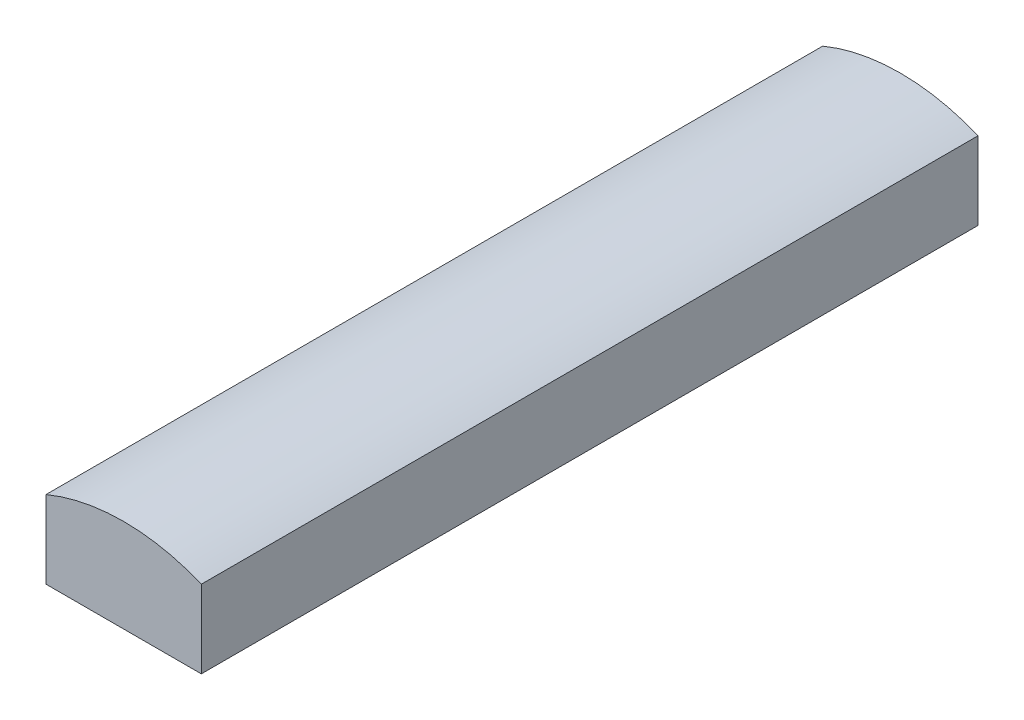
from build123d import *

# Parameters (mm, degrees)
LINEAR_AUSTRAGEN1_DEPTH         = 500.1
SKIZZE3_R                       = 0.05
LINEAR_AUSTRAGEN2_DEPTH         = 0.1
SCHNITT_LINEAR_START            = -0.1
SCHNITT_LINEAR_AUSTRAGEN1_DEPTH = 0.1


with BuildPart() as part:
    # Skizze1 → Linear austragen1 (new body)
    with BuildSketch(Plane.XY):
        with BuildLine():
            Line((50, 0), (50, 50))
            ThreePointArc((50, 50), (0, 60), (-50, 50))
            Line((-50, 50), (-50, 0))
            Line((-50, 0), (50, 0))
        make_face()
    extrude(amount=-LINEAR_AUSTRAGEN1_DEPTH)

    # Skizze3 → Linear austragen2 (add)
    with BuildSketch(Plane.XZ):
        with Locations(Location((-9.708609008, -27.383806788, 0), (0, 0, 270))):
            Circle(SKIZZE3_R)
    extrude(amount=LINEAR_AUSTRAGEN2_DEPTH)

    # Skizze4 → Schnitt-Linear austragen1 (cut)
    with BuildSketch(Plane(origin=(0, 0, -500.1), x_dir=(-1, 0, 0), z_dir=(0, 0, -1)).offset(SCHNITT_LINEAR_START)):
        with BuildLine():
            Line((-50, 0), (50, 0))
            Line((50, 0), (50, 50))
            ThreePointArc((50, 50), (0, 60), (-50, 50))
            Line((-50, 50), (-50, 0))
        make_face()
    extrude(amount=SCHNITT_LINEAR_AUSTRAGEN1_DEPTH, mode=Mode.SUBTRACT)


solid = part.part
